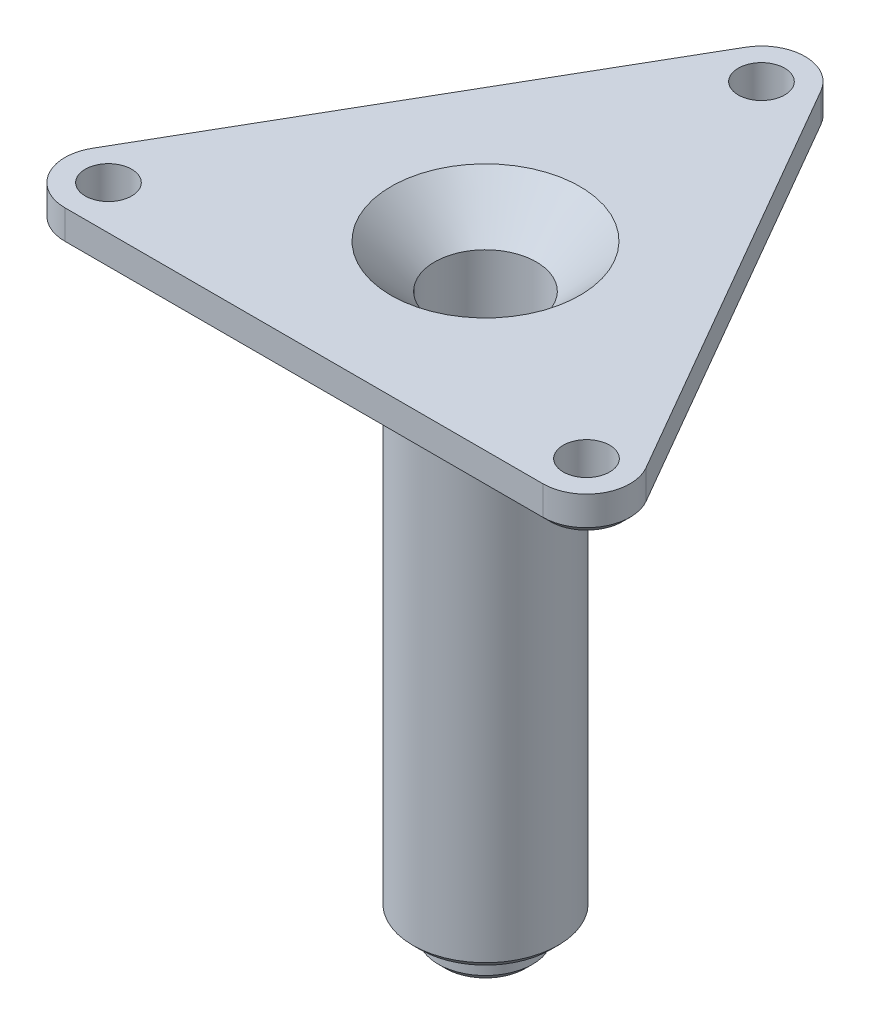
ISO-10303-21;
HEADER;
FILE_DESCRIPTION(('STEP AP214'),'2;1');
FILE_NAME('part.step','',(''),(''),'','','');
FILE_SCHEMA(('AUTOMOTIVE_DESIGN { 1 0 10303 214 1 1 1 1 }'));
ENDSEC;
DATA;
#1=APPLICATION_CONTEXT('core data for automotive mechanical design processes');
#2=APPLICATION_PROTOCOL_DEFINITION('international standard','automotive_design',2000,#1);
#3=PRODUCT_CONTEXT('',#1,'mechanical');
#4=PRODUCT('Part','Part','',(#3));
#5=PRODUCT_RELATED_PRODUCT_CATEGORY('part','',(#4));
#6=PRODUCT_DEFINITION_FORMATION('','',#4);
#7=PRODUCT_DEFINITION_CONTEXT('part definition',#1,'design');
#8=PRODUCT_DEFINITION('design','',#6,#7);
#9=PRODUCT_DEFINITION_SHAPE('','',#8);
#10=(LENGTH_UNIT() NAMED_UNIT(*) SI_UNIT(.MILLI.,.METRE.));
#11=(NAMED_UNIT(*) PLANE_ANGLE_UNIT() SI_UNIT($,.RADIAN.));
#12=(NAMED_UNIT(*) SI_UNIT($,.STERADIAN.) SOLID_ANGLE_UNIT());
#13=UNCERTAINTY_MEASURE_WITH_UNIT(LENGTH_MEASURE(1.E-05),#10,'distance_accuracy_value','');
#14=(GEOMETRIC_REPRESENTATION_CONTEXT(3) GLOBAL_UNCERTAINTY_ASSIGNED_CONTEXT((#13)) GLOBAL_UNIT_ASSIGNED_CONTEXT((#10,
#11,#12)) REPRESENTATION_CONTEXT('',''));
#15=CARTESIAN_POINT('',(0.,0.,0.));
#16=DIRECTION('',(0.,0.,1.));
#17=DIRECTION('',(1.,0.,0.));
#18=AXIS2_PLACEMENT_3D('',#15,#16,#17);
#19=CARTESIAN_POINT('',(3.04843682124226,-2.,-1.12673552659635));
#20=DIRECTION('',(-0.499999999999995,0.,0.866025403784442));
#21=DIRECTION('',(0.866025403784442,0.,0.499999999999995));
#22=AXIS2_PLACEMENT_3D('',#19,#20,#21);
#23=PLANE('',#22);
#24=DIRECTION('',(0.866025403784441,0.,0.499999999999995));
#25=VECTOR('',#24,1.);
#26=CARTESIAN_POINT('',(-0.548436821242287,-1.5,-3.20339149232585));
#27=LINE('',#26,#25);
#28=CARTESIAN_POINT('',(-0.548436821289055,-1.50000000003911,-3.2033914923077));
#29=VERTEX_POINT('',#28);
#30=CARTESIAN_POINT('',(3.04843682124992,-1.50000000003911,-1.12673552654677));
#31=VERTEX_POINT('',#30);
#32=EDGE_CURVE('E306',#29,#31,#27,.T.);
#33=ORIENTED_EDGE('',*,*,#32,.F.);
#34=DIRECTION('',(0.,1.,0.));
#35=VECTOR('',#34,1.);
#36=CARTESIAN_POINT('',(-0.548436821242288,-2.,-3.20339149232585));
#37=LINE('',#36,#35);
#38=CARTESIAN_POINT('',(-0.548436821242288,0.,-3.20339149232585));
#39=VERTEX_POINT('',#38);
#40=EDGE_CURVE('E478',#39,#29,#37,.F.);
#41=ORIENTED_EDGE('',*,*,#40,.F.);
#42=DIRECTION('',(0.866025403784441,0.,0.499999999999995));
#43=VECTOR('',#42,1.);
#44=CARTESIAN_POINT('',(-0.548436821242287,0.,-3.20339149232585));
#45=LINE('',#44,#43);
#46=CARTESIAN_POINT('',(3.04843682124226,0.,-1.12673552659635));
#47=VERTEX_POINT('',#46);
#48=EDGE_CURVE('E296',#39,#47,#45,.T.);
#49=ORIENTED_EDGE('',*,*,#48,.T.);
#50=DIRECTION('',(0.,1.,0.));
#51=VECTOR('',#50,1.);
#52=CARTESIAN_POINT('',(3.04843682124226,-2.,-1.12673552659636));
#53=LINE('',#52,#51);
#54=EDGE_CURVE('E475',#31,#47,#53,.T.);
#55=ORIENTED_EDGE('',*,*,#54,.F.);
#56=EDGE_LOOP('',(#33,#41,#49,#55));
#57=FACE_BOUND('',#56,.T.);
#58=ADVANCED_FACE('F17',(#57),#23,.F.);
#59=CARTESIAN_POINT('',(0.,-2.,0.));
#60=DIRECTION('',(0.,1.,0.));
#61=DIRECTION('',(0.,0.,1.));
#62=AXIS2_PLACEMENT_3D('',#59,#60,#61);
#63=CYLINDRICAL_SURFACE('',#62,3.25);
#64=ORIENTED_EDGE('',*,*,#54,.T.);
#65=CARTESIAN_POINT('',(0.,0.,0.));
#66=DIRECTION('',(0.,1.,0.));
#67=DIRECTION('',(0.,0.,1.));
#68=AXIS2_PLACEMENT_3D('',#65,#66,#67);
#69=CIRCLE('',#68,3.25);
#70=EDGE_CURVE('E299',#47,#39,#69,.F.);
#71=ORIENTED_EDGE('',*,*,#70,.T.);
#72=ORIENTED_EDGE('',*,*,#40,.T.);
#73=CARTESIAN_POINT('',(0.,-1.50000000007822,0.));
#74=DIRECTION('',(0.,1.,0.));
#75=DIRECTION('',(0.,0.,1.));
#76=AXIS2_PLACEMENT_3D('',#73,#74,#75);
#77=CIRCLE('',#76,3.24999999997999);
#78=EDGE_CURVE('E307',#31,#29,#77,.F.);
#79=ORIENTED_EDGE('',*,*,#78,.F.);
#80=EDGE_LOOP('',(#64,#71,#72,#79));
#81=FACE_BOUND('',#80,.T.);
#82=ADVANCED_FACE('F326',(#81),#63,.T.);
#83=CARTESIAN_POINT('',(0.,-1.50000000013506,0.));
#84=DIRECTION('',(0.,1.,0.));
#85=DIRECTION('',(0.,0.,1.));
#86=AXIS2_PLACEMENT_3D('',#83,#84,#85);
#87=CONICAL_SURFACE('',#86,3.2499999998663,0.785398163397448);
#88=ORIENTED_EDGE('',*,*,#78,.T.);
#89=CARTESIAN_POINT('',(-0.634587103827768,-2.,-2.67578011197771));
#90=CARTESIAN_POINT('',(-0.597477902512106,-1.76193187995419,-2.92925249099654));
#91=CARTESIAN_POINT('',(-0.548436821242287,-1.5,-3.20339149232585));
#92=B_SPLINE_CURVE_WITH_KNOTS('',2,(#89,#90,#91),.UNSPECIFIED.,.F.,.F.,(3,3),(0.,1.),.UNSPECIFIED.);
#93=CARTESIAN_POINT('',(-0.634587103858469,-1.99999999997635,-2.67578011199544));
#94=VERTEX_POINT('',#93);
#95=EDGE_CURVE('E301',#94,#29,#92,.T.);
#96=ORIENTED_EDGE('',*,*,#95,.F.);
#97=CARTESIAN_POINT('',(0.,-1.99999999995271,0.));
#98=DIRECTION('',(0.,1.,0.));
#99=DIRECTION('',(0.,0.,1.));
#100=AXIS2_PLACEMENT_3D('',#97,#98,#99);
#101=CIRCLE('',#100,2.75000000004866);
#102=CARTESIAN_POINT('',(2.63458710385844,-1.99999999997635,-0.788321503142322));
#103=VERTEX_POINT('',#102);
#104=EDGE_CURVE('E91',#103,#94,#101,.F.);
#105=ORIENTED_EDGE('',*,*,#104,.F.);
#106=CARTESIAN_POINT('',(3.04843682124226,-1.5,-1.12673552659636));
#107=CARTESIAN_POINT('',(2.83554602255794,-1.76193187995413,-0.947195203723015));
#108=CARTESIAN_POINT('',(2.63458710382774,-2.,-0.788321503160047));
#109=B_SPLINE_CURVE_WITH_KNOTS('',2,(#106,#107,#108),.UNSPECIFIED.,.F.,.F.,(3,3),(0.,1.),.UNSPECIFIED.);
#110=EDGE_CURVE('E300',#31,#103,#109,.T.);
#111=ORIENTED_EDGE('',*,*,#110,.F.);
#112=EDGE_LOOP('',(#88,#96,#105,#111));
#113=FACE_BOUND('',#112,.T.);
#114=ADVANCED_FACE('F321',(#113),#87,.T.);
#115=CARTESIAN_POINT('',(0.999999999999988,-2.,-1.73205080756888));
#116=DIRECTION('',(0.353553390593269,-0.707106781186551,-0.612372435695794));
#117=DIRECTION('',(0.,0.654653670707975,-0.755928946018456));
#118=AXIS2_PLACEMENT_3D('',#115,#116,#117);
#119=PLANE('',#118);
#120=ORIENTED_EDGE('',*,*,#110,.T.);
#121=DIRECTION('',(0.866025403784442,0.,0.499999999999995));
#122=VECTOR('',#121,1.);
#123=CARTESIAN_POINT('',(-0.634587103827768,-2.,-2.67578011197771));
#124=LINE('',#123,#122);
#125=EDGE_CURVE('E293',#94,#103,#124,.T.);
#126=ORIENTED_EDGE('',*,*,#125,.F.);
#127=ORIENTED_EDGE('',*,*,#95,.T.);
#128=ORIENTED_EDGE('',*,*,#32,.T.);
#129=EDGE_LOOP('',(#120,#126,#127,#128));
#130=FACE_BOUND('',#129,.T.);
#131=ADVANCED_FACE('F310',(#130),#119,.T.);
#132=CARTESIAN_POINT('',(0.,0.,0.));
#133=DIRECTION('',(0.,1.,0.));
#134=DIRECTION('',(0.,0.,1.));
#135=AXIS2_PLACEMENT_3D('',#132,#133,#134);
#136=PLANE('',#135);
#137=ORIENTED_EDGE('',*,*,#48,.F.);
#138=ORIENTED_EDGE('',*,*,#70,.F.);
#139=EDGE_LOOP('',(#137,#138));
#140=FACE_BOUND('',#139,.T.);
#141=CARTESIAN_POINT('',(0.,-5.6843418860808E-11,0.));
#142=DIRECTION('',(0.,1.,0.));
#143=DIRECTION('',(0.,0.,1.));
#144=AXIS2_PLACEMENT_3D('',#141,#142,#143);
#145=CIRCLE('',#144,4.50000000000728);
#146=CARTESIAN_POINT('',(0.,-5.6843418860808E-11,4.50000000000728));
#147=VERTEX_POINT('',#146);
#148=EDGE_CURVE('E295',#147,#147,#145,.T.);
#149=ORIENTED_EDGE('',*,*,#148,.F.);
#150=EDGE_LOOP('',(#149));
#151=FACE_BOUND('',#150,.T.);
#152=ADVANCED_FACE('F320',(#140,#151),#136,.F.);
#153=CARTESIAN_POINT('',(0.,-2.,0.));
#154=DIRECTION('',(0.,-1.,0.));
#155=DIRECTION('',(0.,0.,-1.));
#156=AXIS2_PLACEMENT_3D('',#153,#154,#155);
#157=PLANE('',#156);
#158=ORIENTED_EDGE('',*,*,#104,.T.);
#159=ORIENTED_EDGE('',*,*,#125,.T.);
#160=EDGE_LOOP('',(#158,#159));
#161=FACE_BOUND('',#160,.T.);
#162=CARTESIAN_POINT('',(0.,-2.,0.));
#163=DIRECTION('',(0.,-1.,0.));
#164=DIRECTION('',(0.,0.,-1.));
#165=AXIS2_PLACEMENT_3D('',#162,#163,#164);
#166=CIRCLE('',#165,1.24999999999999);
#167=CARTESIAN_POINT('',(0.,-2.,-1.24999999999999));
#168=VERTEX_POINT('',#167);
#169=EDGE_CURVE('E292',#168,#168,#166,.F.);
#170=ORIENTED_EDGE('',*,*,#169,.T.);
#171=EDGE_LOOP('',(#170));
#172=FACE_BOUND('',#171,.T.);
#173=ADVANCED_FACE('F461',(#161,#172),#157,.T.);
#174=CARTESIAN_POINT('',(0.,0.499999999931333,0.));
#175=DIRECTION('',(0.,1.,0.));
#176=DIRECTION('',(0.,0.,1.));
#177=AXIS2_PLACEMENT_3D('',#174,#175,#176);
#178=CONICAL_SURFACE('',#177,5.0000000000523,0.785398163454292);
#179=CARTESIAN_POINT('',(0.,0.500000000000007,0.));
#180=DIRECTION('',(0.,1.,0.));
#181=DIRECTION('',(0.,0.,1.));
#182=AXIS2_PLACEMENT_3D('',#179,#180,#181);
#183=CIRCLE('',#182,5.00000000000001);
#184=CARTESIAN_POINT('',(0.,0.500000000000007,5.00000000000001));
#185=VERTEX_POINT('',#184);
#186=EDGE_CURVE('E289',#185,#185,#183,.T.);
#187=ORIENTED_EDGE('',*,*,#186,.F.);
#188=EDGE_LOOP('',(#187));
#189=FACE_BOUND('',#188,.T.);
#190=ORIENTED_EDGE('',*,*,#148,.T.);
#191=EDGE_LOOP('',(#190));
#192=FACE_BOUND('',#191,.T.);
#193=ADVANCED_FACE('F458',(#189,#192),#178,.T.);
#194=CARTESIAN_POINT('',(0.,-2.,0.));
#195=DIRECTION('',(0.,-1.,0.));
#196=DIRECTION('',(0.,0.,-1.));
#197=AXIS2_PLACEMENT_3D('',#194,#195,#196);
#198=CYLINDRICAL_SURFACE('',#197,1.24999999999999);
#199=ORIENTED_EDGE('',*,*,#169,.F.);
#200=EDGE_LOOP('',(#199));
#201=FACE_BOUND('',#200,.T.);
#202=CARTESIAN_POINT('',(0.,5.,0.));
#203=DIRECTION('',(0.,-1.,0.));
#204=DIRECTION('',(0.,0.,-1.));
#205=AXIS2_PLACEMENT_3D('',#202,#203,#204);
#206=CIRCLE('',#205,1.24999999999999);
#207=CARTESIAN_POINT('',(0.,5.,-1.24999999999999));
#208=VERTEX_POINT('',#207);
#209=EDGE_CURVE('E288',#208,#208,#206,.T.);
#210=ORIENTED_EDGE('',*,*,#209,.F.);
#211=EDGE_LOOP('',(#210));
#212=FACE_BOUND('',#211,.T.);
#213=ADVANCED_FACE('F455',(#201,#212),#198,.F.);
#214=CARTESIAN_POINT('',(0.,61.2763291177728,0.));
#215=DIRECTION('',(0.,1.,0.));
#216=DIRECTION('',(0.,0.,1.));
#217=AXIS2_PLACEMENT_3D('',#214,#215,#216);
#218=CYLINDRICAL_SURFACE('',#217,5.00000000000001);
#219=CARTESIAN_POINT('',(0.,32.5,0.));
#220=DIRECTION('',(0.,1.,0.));
#221=DIRECTION('',(0.,0.,1.));
#222=AXIS2_PLACEMENT_3D('',#219,#220,#221);
#223=CIRCLE('',#222,5.00000000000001);
#224=CARTESIAN_POINT('',(0.,32.5,5.00000000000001));
#225=VERTEX_POINT('',#224);
#226=EDGE_CURVE('E279',#225,#225,#223,.F.);
#227=ORIENTED_EDGE('',*,*,#226,.T.);
#228=EDGE_LOOP('',(#227));
#229=FACE_BOUND('',#228,.T.);
#230=ORIENTED_EDGE('',*,*,#186,.T.);
#231=EDGE_LOOP('',(#230));
#232=FACE_BOUND('',#231,.T.);
#233=ADVANCED_FACE('F452',(#229,#232),#218,.T.);
#234=CARTESIAN_POINT('',(0.,5.,0.));
#235=DIRECTION('',(0.,1.,0.));
#236=DIRECTION('',(0.,0.,1.));
#237=AXIS2_PLACEMENT_3D('',#234,#235,#236);
#238=PLANE('',#237);
#239=ORIENTED_EDGE('',*,*,#209,.T.);
#240=EDGE_LOOP('',(#239));
#241=FACE_BOUND('',#240,.T.);
#242=CARTESIAN_POINT('',(0.,5.,0.));
#243=DIRECTION('',(0.,1.,0.));
#244=DIRECTION('',(0.,0.,1.));
#245=AXIS2_PLACEMENT_3D('',#242,#243,#244);
#246=CIRCLE('',#245,3.5);
#247=CARTESIAN_POINT('',(0.,5.,3.5));
#248=VERTEX_POINT('',#247);
#249=EDGE_CURVE('E287',#248,#248,#246,.T.);
#250=ORIENTED_EDGE('',*,*,#249,.T.);
#251=EDGE_LOOP('',(#250));
#252=FACE_BOUND('',#251,.T.);
#253=ADVANCED_FACE('F272',(#241,#252),#238,.T.);
#254=CARTESIAN_POINT('',(0.,32.5,0.));
#255=DIRECTION('',(0.,1.,0.));
#256=DIRECTION('',(0.,0.,1.));
#257=AXIS2_PLACEMENT_3D('',#254,#255,#256);
#258=TOROIDAL_SURFACE('',#257,10.,5.);
#259=CARTESIAN_POINT('',(0.,37.5,0.));
#260=DIRECTION('',(0.,-1.,0.));
#261=DIRECTION('',(0.,0.,-1.));
#262=AXIS2_PLACEMENT_3D('',#259,#260,#261);
#263=CIRCLE('',#262,10.);
#264=CARTESIAN_POINT('',(0.,37.5,-10.));
#265=VERTEX_POINT('',#264);
#266=CARTESIAN_POINT('',(0.,37.5,10.));
#267=VERTEX_POINT('',#266);
#268=EDGE_CURVE('E439',#265,#267,#263,.T.);
#269=ORIENTED_EDGE('',*,*,#268,.T.);
#270=CARTESIAN_POINT('',(0.,37.5,0.));
#271=DIRECTION('',(0.,-1.,0.));
#272=DIRECTION('',(0.,0.,1.));
#273=AXIS2_PLACEMENT_3D('',#270,#271,#272);
#274=CIRCLE('',#273,10.);
#275=EDGE_CURVE('E97',#267,#265,#274,.T.);
#276=ORIENTED_EDGE('',*,*,#275,.T.);
#277=EDGE_LOOP('',(#269,#276));
#278=FACE_BOUND('',#277,.T.);
#279=ORIENTED_EDGE('',*,*,#226,.F.);
#280=EDGE_LOOP('',(#279));
#281=FACE_BOUND('',#280,.T.);
#282=ADVANCED_FACE('F268',(#278,#281),#258,.F.);
#283=CARTESIAN_POINT('',(0.,5.,0.));
#284=DIRECTION('',(0.,1.,0.));
#285=DIRECTION('',(0.,0.,1.));
#286=AXIS2_PLACEMENT_3D('',#283,#284,#285);
#287=CYLINDRICAL_SURFACE('',#286,3.5);
#288=CARTESIAN_POINT('',(0.,36.9999999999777,0.));
#289=DIRECTION('',(0.,1.,0.));
#290=DIRECTION('',(0.,0.,1.));
#291=AXIS2_PLACEMENT_3D('',#288,#289,#290);
#292=CIRCLE('',#291,3.49999999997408);
#293=CARTESIAN_POINT('',(0.,36.9999999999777,3.49999999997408));
#294=VERTEX_POINT('',#293);
#295=EDGE_CURVE('E130',#294,#294,#292,.T.);
#296=ORIENTED_EDGE('',*,*,#295,.T.);
#297=EDGE_LOOP('',(#296));
#298=FACE_BOUND('',#297,.T.);
#299=ORIENTED_EDGE('',*,*,#249,.F.);
#300=EDGE_LOOP('',(#299));
#301=FACE_BOUND('',#300,.T.);
#302=ADVANCED_FACE('F245',(#298,#301),#287,.F.);
#303=CARTESIAN_POINT('',(5.00000000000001,37.5,0.));
#304=DIRECTION('',(0.,1.,0.));
#305=DIRECTION('',(0.,0.,1.));
#306=AXIS2_PLACEMENT_3D('',#303,#304,#305);
#307=PLANE('',#306);
#308=CARTESIAN_POINT('',(0.,37.5,-19.));
#309=DIRECTION('',(0.,1.,0.));
#310=DIRECTION('',(0.,0.,1.));
#311=AXIS2_PLACEMENT_3D('',#308,#309,#310);
#312=CIRCLE('',#311,1.6);
#313=CARTESIAN_POINT('',(0.,37.5,-17.4));
#314=VERTEX_POINT('',#313);
#315=EDGE_CURVE('E195',#314,#314,#312,.T.);
#316=ORIENTED_EDGE('',*,*,#315,.T.);
#317=EDGE_LOOP('',(#316));
#318=FACE_BOUND('',#317,.T.);
#319=CARTESIAN_POINT('',(16.4544826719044,37.5,9.49999999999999));
#320=DIRECTION('',(0.,1.,0.));
#321=DIRECTION('',(0.,0.,1.));
#322=AXIS2_PLACEMENT_3D('',#319,#320,#321);
#323=CIRCLE('',#322,1.6);
#324=CARTESIAN_POINT('',(16.4544826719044,37.5,11.1));
#325=VERTEX_POINT('',#324);
#326=EDGE_CURVE('E431',#325,#325,#323,.T.);
#327=ORIENTED_EDGE('',*,*,#326,.T.);
#328=EDGE_LOOP('',(#327));
#329=FACE_BOUND('',#328,.T.);
#330=CARTESIAN_POINT('',(-16.4544826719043,37.5,9.50000000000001));
#331=DIRECTION('',(0.,1.,0.));
#332=DIRECTION('',(0.,0.,1.));
#333=AXIS2_PLACEMENT_3D('',#330,#331,#332);
#334=CIRCLE('',#333,1.6);
#335=CARTESIAN_POINT('',(-16.4544826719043,37.5,11.1));
#336=VERTEX_POINT('',#335);
#337=EDGE_CURVE('E259',#336,#336,#334,.T.);
#338=ORIENTED_EDGE('',*,*,#337,.T.);
#339=EDGE_LOOP('',(#338));
#340=FACE_BOUND('',#339,.T.);
#341=CARTESIAN_POINT('',(0.,37.5000000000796,-19.));
#342=DIRECTION('',(0.,1.,0.));
#343=DIRECTION('',(0.,0.,1.));
#344=AXIS2_PLACEMENT_3D('',#341,#342,#343);
#345=CIRCLE('',#344,2.49999999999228);
#346=CARTESIAN_POINT('',(2.16506350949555,37.5000000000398,-20.2500000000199));
#347=VERTEX_POINT('',#346);
#348=CARTESIAN_POINT('',(-2.16506350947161,37.5000000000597,-20.2499999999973));
#349=VERTEX_POINT('',#348);
#350=EDGE_CURVE('E190',#347,#349,#345,.T.);
#351=ORIENTED_EDGE('',*,*,#350,.F.);
#352=DIRECTION('',(-0.5,0.,-0.866025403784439));
#353=VECTOR('',#352,1.);
#354=CARTESIAN_POINT('',(18.6195461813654,37.5,8.25));
#355=LINE('',#354,#353);
#356=CARTESIAN_POINT('',(18.6195461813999,37.5000000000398,8.2499999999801));
#357=VERTEX_POINT('',#356);
#358=EDGE_CURVE('E125',#357,#347,#355,.T.);
#359=ORIENTED_EDGE('',*,*,#358,.F.);
#360=CARTESIAN_POINT('',(16.4544826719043,37.5000000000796,9.5));
#361=DIRECTION('',(0.,1.,0.));
#362=DIRECTION('',(0.,0.,1.));
#363=AXIS2_PLACEMENT_3D('',#360,#361,#362);
#364=CIRCLE('',#363,2.50000000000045);
#365=CARTESIAN_POINT('',(16.4544826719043,37.5000000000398,12.0000000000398));
#366=VERTEX_POINT('',#365);
#367=EDGE_CURVE('E226',#366,#357,#364,.T.);
#368=ORIENTED_EDGE('',*,*,#367,.F.);
#369=DIRECTION('',(1.,0.,0.));
#370=VECTOR('',#369,1.);
#371=CARTESIAN_POINT('',(-21.650635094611,37.5,12.));
#372=LINE('',#371,#370);
#373=CARTESIAN_POINT('',(-16.4544826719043,37.4999999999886,11.9999999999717));
#374=VERTEX_POINT('',#373);
#375=EDGE_CURVE('E221',#374,#366,#372,.T.);
#376=ORIENTED_EDGE('',*,*,#375,.F.);
#377=CARTESIAN_POINT('',(-16.4544826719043,37.5000000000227,9.5));
#378=DIRECTION('',(0.,1.,0.));
#379=DIRECTION('',(0.,0.,1.));
#380=AXIS2_PLACEMENT_3D('',#377,#378,#379);
#381=CIRCLE('',#380,2.50000000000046);
#382=CARTESIAN_POINT('',(-18.6195461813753,37.5000000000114,8.24999999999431));
#383=VERTEX_POINT('',#382);
#384=EDGE_CURVE('E212',#383,#374,#381,.T.);
#385=ORIENTED_EDGE('',*,*,#384,.F.);
#386=DIRECTION('',(-0.5,0.,0.866025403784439));
#387=VECTOR('',#386,1.);
#388=CARTESIAN_POINT('',(-2.1650635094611,37.5,-20.25));
#389=LINE('',#388,#387);
#390=EDGE_CURVE('E203',#349,#383,#389,.T.);
#391=ORIENTED_EDGE('',*,*,#390,.F.);
#392=EDGE_LOOP('',(#351,#359,#368,#376,#385,#391));
#393=FACE_BOUND('',#392,.T.);
#394=ORIENTED_EDGE('',*,*,#275,.F.);
#395=ORIENTED_EDGE('',*,*,#268,.F.);
#396=EDGE_LOOP('',(#394,#395));
#397=FACE_BOUND('',#396,.T.);
#398=ADVANCED_FACE('F234',(#318,#329,#340,#393,#397),#307,.F.);
#399=CARTESIAN_POINT('',(16.4544826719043,38.0000000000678,9.5));
#400=DIRECTION('',(0.,1.,0.));
#401=DIRECTION('',(0.,0.,1.));
#402=AXIS2_PLACEMENT_3D('',#399,#400,#401);
#403=CONICAL_SURFACE('',#402,2.99999999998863,0.785398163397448);
#404=DIRECTION('',(-0.612372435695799,-0.707106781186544,0.353553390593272));
#405=VECTOR('',#404,1.);
#406=CARTESIAN_POINT('',(19.0525588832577,38.,8.));
#407=LINE('',#406,#405);
#408=CARTESIAN_POINT('',(19.0525588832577,38.,8.));
#409=VERTEX_POINT('',#408);
#410=EDGE_CURVE('E188',#409,#357,#407,.T.);
#411=ORIENTED_EDGE('',*,*,#410,.F.);
#412=CARTESIAN_POINT('',(16.4544826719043,38.,9.5));
#413=DIRECTION('',(0.,1.,0.));
#414=DIRECTION('',(0.,0.,1.));
#415=AXIS2_PLACEMENT_3D('',#412,#413,#414);
#416=CIRCLE('',#415,3.);
#417=CARTESIAN_POINT('',(16.4544826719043,38.,12.5));
#418=VERTEX_POINT('',#417);
#419=EDGE_CURVE('E193',#418,#409,#416,.T.);
#420=ORIENTED_EDGE('',*,*,#419,.F.);
#421=DIRECTION('',(0.,-0.707106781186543,-0.707106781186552));
#422=VECTOR('',#421,1.);
#423=CARTESIAN_POINT('',(16.4544826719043,38.,12.5));
#424=LINE('',#423,#422);
#425=EDGE_CURVE('E224',#366,#418,#424,.F.);
#426=ORIENTED_EDGE('',*,*,#425,.F.);
#427=ORIENTED_EDGE('',*,*,#367,.T.);
#428=EDGE_LOOP('',(#411,#420,#426,#427));
#429=FACE_BOUND('',#428,.T.);
#430=ADVANCED_FACE('F244',(#429),#403,.T.);
#431=CARTESIAN_POINT('',(-21.650635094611,38.,12.5));
#432=DIRECTION('',(0.,-0.707106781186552,0.707106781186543));
#433=DIRECTION('',(0.,-0.707106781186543,-0.707106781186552));
#434=AXIS2_PLACEMENT_3D('',#431,#432,#433);
#435=PLANE('',#434);
#436=DIRECTION('',(0.,-0.707106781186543,-0.707106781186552));
#437=VECTOR('',#436,1.);
#438=CARTESIAN_POINT('',(-16.4544826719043,499000.,498974.500000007));
#439=LINE('',#438,#437);
#440=CARTESIAN_POINT('',(-16.4544826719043,37.9999999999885,12.4999999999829));
#441=VERTEX_POINT('',#440);
#442=EDGE_CURVE('E219',#374,#441,#439,.F.);
#443=ORIENTED_EDGE('',*,*,#442,.F.);
#444=ORIENTED_EDGE('',*,*,#375,.T.);
#445=ORIENTED_EDGE('',*,*,#425,.T.);
#446=DIRECTION('',(1.,0.,0.));
#447=VECTOR('',#446,1.);
#448=CARTESIAN_POINT('',(-21.650635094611,38.,12.5));
#449=LINE('',#448,#447);
#450=EDGE_CURVE('E179',#441,#418,#449,.T.);
#451=ORIENTED_EDGE('',*,*,#450,.F.);
#452=EDGE_LOOP('',(#443,#444,#445,#451));
#453=FACE_BOUND('',#452,.T.);
#454=ADVANCED_FACE('F389',(#453),#435,.T.);
#455=CARTESIAN_POINT('',(-16.4544826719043,37.9999999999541,9.5));
#456=DIRECTION('',(0.,1.,0.));
#457=DIRECTION('',(0.,0.,1.));
#458=AXIS2_PLACEMENT_3D('',#455,#456,#457);
#459=CONICAL_SURFACE('',#458,2.99999999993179,0.785398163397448);
#460=DIRECTION('',(-0.612372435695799,0.707106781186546,-0.353553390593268));
#461=VECTOR('',#460,1.);
#462=CARTESIAN_POINT('',(-18.6195461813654,37.5,8.25));
#463=LINE('',#462,#461);
#464=CARTESIAN_POINT('',(-19.0525588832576,38.,8.));
#465=VERTEX_POINT('',#464);
#466=EDGE_CURVE('E210',#383,#465,#463,.T.);
#467=ORIENTED_EDGE('',*,*,#466,.F.);
#468=ORIENTED_EDGE('',*,*,#384,.T.);
#469=ORIENTED_EDGE('',*,*,#442,.T.);
#470=CARTESIAN_POINT('',(-16.4544826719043,38.,9.5));
#471=DIRECTION('',(0.,1.,0.));
#472=DIRECTION('',(0.,0.,1.));
#473=AXIS2_PLACEMENT_3D('',#470,#471,#472);
#474=CIRCLE('',#473,3.);
#475=EDGE_CURVE('E174',#465,#441,#474,.T.);
#476=ORIENTED_EDGE('',*,*,#475,.F.);
#477=EDGE_LOOP('',(#467,#468,#469,#476));
#478=FACE_BOUND('',#477,.T.);
#479=ADVANCED_FACE('F386',(#478),#459,.T.);
#480=CARTESIAN_POINT('',(0.,38.,-25.));
#481=DIRECTION('',(-0.612372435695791,-0.707106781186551,-0.353553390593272));
#482=DIRECTION('',(0.755928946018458,-0.654653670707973,0.));
#483=AXIS2_PLACEMENT_3D('',#480,#481,#482);
#484=PLANE('',#483);
#485=DIRECTION('',(0.612372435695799,-0.707106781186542,0.353553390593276));
#486=VECTOR('',#485,1.);
#487=CARTESIAN_POINT('',(-432116.365599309,499000.,-249501.500000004));
#488=LINE('',#487,#486);
#489=CARTESIAN_POINT('',(-2.5980762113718,38.0000000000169,-20.4999999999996));
#490=VERTEX_POINT('',#489);
#491=EDGE_CURVE('E142',#349,#490,#488,.F.);
#492=ORIENTED_EDGE('',*,*,#491,.F.);
#493=ORIENTED_EDGE('',*,*,#390,.T.);
#494=ORIENTED_EDGE('',*,*,#466,.T.);
#495=DIRECTION('',(-0.5,0.,0.866025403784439));
#496=VECTOR('',#495,1.);
#497=CARTESIAN_POINT('',(0.,38.,-25.));
#498=LINE('',#497,#496);
#499=EDGE_CURVE('E169',#490,#465,#498,.T.);
#500=ORIENTED_EDGE('',*,*,#499,.F.);
#501=EDGE_LOOP('',(#492,#493,#494,#500));
#502=FACE_BOUND('',#501,.T.);
#503=ADVANCED_FACE('F383',(#502),#484,.T.);
#504=CARTESIAN_POINT('',(0.,38.0000000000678,-19.));
#505=DIRECTION('',(0.,1.,0.));
#506=DIRECTION('',(0.,0.,1.));
#507=AXIS2_PLACEMENT_3D('',#504,#505,#506);
#508=CONICAL_SURFACE('',#507,2.99999999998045,0.785398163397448);
#509=DIRECTION('',(0.612372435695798,0.707106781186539,-0.353553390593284));
#510=VECTOR('',#509,1.);
#511=CARTESIAN_POINT('',(2.16506350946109,37.5,-20.25));
#512=LINE('',#511,#510);
#513=CARTESIAN_POINT('',(2.59807621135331,38.,-20.5));
#514=VERTEX_POINT('',#513);
#515=EDGE_CURVE('E120',#347,#514,#512,.T.);
#516=ORIENTED_EDGE('',*,*,#515,.F.);
#517=ORIENTED_EDGE('',*,*,#350,.T.);
#518=ORIENTED_EDGE('',*,*,#491,.T.);
#519=CARTESIAN_POINT('',(0.,38.,-19.));
#520=DIRECTION('',(0.,1.,0.));
#521=DIRECTION('',(0.,0.,1.));
#522=AXIS2_PLACEMENT_3D('',#519,#520,#521);
#523=CIRCLE('',#522,3.);
#524=EDGE_CURVE('E139',#514,#490,#523,.T.);
#525=ORIENTED_EDGE('',*,*,#524,.F.);
#526=EDGE_LOOP('',(#516,#517,#518,#525));
#527=FACE_BOUND('',#526,.T.);
#528=ADVANCED_FACE('F140',(#527),#508,.T.);
#529=CARTESIAN_POINT('',(21.650635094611,38.,12.5));
#530=DIRECTION('',(0.612372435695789,-0.707106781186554,-0.353553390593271));
#531=DIRECTION('',(0.75592894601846,0.654653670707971,0.));
#532=AXIS2_PLACEMENT_3D('',#529,#530,#531);
#533=PLANE('',#532);
#534=ORIENTED_EDGE('',*,*,#515,.T.);
#535=DIRECTION('',(-0.5,0.,-0.866025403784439));
#536=VECTOR('',#535,1.);
#537=CARTESIAN_POINT('',(21.650635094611,38.,12.5));
#538=LINE('',#537,#536);
#539=EDGE_CURVE('E123',#409,#514,#538,.T.);
#540=ORIENTED_EDGE('',*,*,#539,.F.);
#541=ORIENTED_EDGE('',*,*,#410,.T.);
#542=ORIENTED_EDGE('',*,*,#358,.T.);
#543=EDGE_LOOP('',(#534,#540,#541,#542));
#544=FACE_BOUND('',#543,.T.);
#545=ADVANCED_FACE('F121',(#544),#533,.T.);
#546=CARTESIAN_POINT('',(0.,40.0000000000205,0.));
#547=DIRECTION('',(0.,1.,0.));
#548=DIRECTION('',(0.,0.,1.));
#549=AXIS2_PLACEMENT_3D('',#546,#547,#548);
#550=CONICAL_SURFACE('',#549,6.49999999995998,0.785398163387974);
#551=CARTESIAN_POINT('',(0.,40.0000000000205,0.));
#552=DIRECTION('',(0.,1.,0.));
#553=DIRECTION('',(0.,0.,1.));
#554=AXIS2_PLACEMENT_3D('',#551,#552,#553);
#555=CIRCLE('',#554,6.49999999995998);
#556=CARTESIAN_POINT('',(0.,40.0000000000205,6.49999999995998));
#557=VERTEX_POINT('',#556);
#558=EDGE_CURVE('E151',#557,#557,#555,.T.);
#559=ORIENTED_EDGE('',*,*,#558,.T.);
#560=EDGE_LOOP('',(#559));
#561=FACE_BOUND('',#560,.T.);
#562=ORIENTED_EDGE('',*,*,#295,.F.);
#563=EDGE_LOOP('',(#562));
#564=FACE_BOUND('',#563,.T.);
#565=ADVANCED_FACE('F374',(#561,#564),#550,.F.);
#566=CARTESIAN_POINT('',(-16.4544826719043,32.9745166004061,9.50000000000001));
#567=DIRECTION('',(0.,1.,0.));
#568=DIRECTION('',(0.,0.,1.));
#569=AXIS2_PLACEMENT_3D('',#566,#567,#568);
#570=CYLINDRICAL_SURFACE('',#569,1.6);
#571=ORIENTED_EDGE('',*,*,#337,.F.);
#572=EDGE_LOOP('',(#571));
#573=FACE_BOUND('',#572,.T.);
#574=CARTESIAN_POINT('',(-16.4544826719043,40.,9.50000000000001));
#575=DIRECTION('',(0.,1.,0.));
#576=DIRECTION('',(0.,0.,1.));
#577=AXIS2_PLACEMENT_3D('',#574,#575,#576);
#578=CIRCLE('',#577,1.6);
#579=CARTESIAN_POINT('',(-16.4544826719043,40.,11.1));
#580=VERTEX_POINT('',#579);
#581=EDGE_CURVE('E154',#580,#580,#578,.T.);
#582=ORIENTED_EDGE('',*,*,#581,.T.);
#583=EDGE_LOOP('',(#582));
#584=FACE_BOUND('',#583,.T.);
#585=ADVANCED_FACE('F370',(#573,#584),#570,.F.);
#586=CARTESIAN_POINT('',(16.4544826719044,32.9745166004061,9.49999999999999));
#587=DIRECTION('',(0.,1.,0.));
#588=DIRECTION('',(0.,0.,1.));
#589=AXIS2_PLACEMENT_3D('',#586,#587,#588);
#590=CYLINDRICAL_SURFACE('',#589,1.6);
#591=ORIENTED_EDGE('',*,*,#326,.F.);
#592=EDGE_LOOP('',(#591));
#593=FACE_BOUND('',#592,.T.);
#594=CARTESIAN_POINT('',(16.4544826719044,40.,9.49999999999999));
#595=DIRECTION('',(0.,1.,0.));
#596=DIRECTION('',(0.,0.,1.));
#597=AXIS2_PLACEMENT_3D('',#594,#595,#596);
#598=CIRCLE('',#597,1.6);
#599=CARTESIAN_POINT('',(16.4544826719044,40.,11.1));
#600=VERTEX_POINT('',#599);
#601=EDGE_CURVE('E424',#600,#600,#598,.T.);
#602=ORIENTED_EDGE('',*,*,#601,.T.);
#603=EDGE_LOOP('',(#602));
#604=FACE_BOUND('',#603,.T.);
#605=ADVANCED_FACE('F366',(#593,#604),#590,.F.);
#606=CARTESIAN_POINT('',(0.,32.9745166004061,-19.));
#607=DIRECTION('',(0.,1.,0.));
#608=DIRECTION('',(0.,0.,1.));
#609=AXIS2_PLACEMENT_3D('',#606,#607,#608);
#610=CYLINDRICAL_SURFACE('',#609,1.6);
#611=ORIENTED_EDGE('',*,*,#315,.F.);
#612=EDGE_LOOP('',(#611));
#613=FACE_BOUND('',#612,.T.);
#614=CARTESIAN_POINT('',(0.,40.,-19.));
#615=DIRECTION('',(0.,1.,0.));
#616=DIRECTION('',(0.,0.,1.));
#617=AXIS2_PLACEMENT_3D('',#614,#615,#616);
#618=CIRCLE('',#617,1.6);
#619=CARTESIAN_POINT('',(0.,40.,-17.4));
#620=VERTEX_POINT('',#619);
#621=EDGE_CURVE('E421',#620,#620,#618,.T.);
#622=ORIENTED_EDGE('',*,*,#621,.T.);
#623=EDGE_LOOP('',(#622));
#624=FACE_BOUND('',#623,.T.);
#625=ADVANCED_FACE('F362',(#613,#624),#610,.F.);
#626=CARTESIAN_POINT('',(16.4544826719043,30.,9.5));
#627=DIRECTION('',(0.,1.,0.));
#628=DIRECTION('',(0.,0.,1.));
#629=AXIS2_PLACEMENT_3D('',#626,#627,#628);
#630=CYLINDRICAL_SURFACE('',#629,3.);
#631=DIRECTION('',(0.,1.,0.));
#632=VECTOR('',#631,1.);
#633=CARTESIAN_POINT('',(19.0525588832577,30.,8.));
#634=LINE('',#633,#632);
#635=CARTESIAN_POINT('',(19.0525588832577,40.,8.));
#636=VERTEX_POINT('',#635);
#637=EDGE_CURVE('E135',#636,#409,#634,.F.);
#638=ORIENTED_EDGE('',*,*,#637,.F.);
#639=CARTESIAN_POINT('',(16.4544826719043,40.,9.5));
#640=DIRECTION('',(0.,1.,0.));
#641=DIRECTION('',(0.,0.,1.));
#642=AXIS2_PLACEMENT_3D('',#639,#640,#641);
#643=CIRCLE('',#642,3.);
#644=CARTESIAN_POINT('',(16.4544826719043,40.,12.5));
#645=VERTEX_POINT('',#644);
#646=EDGE_CURVE('E416',#636,#645,#643,.F.);
#647=ORIENTED_EDGE('',*,*,#646,.T.);
#648=DIRECTION('',(0.,1.,0.));
#649=VECTOR('',#648,1.);
#650=CARTESIAN_POINT('',(16.4544826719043,30.,12.5));
#651=LINE('',#650,#649);
#652=EDGE_CURVE('E177',#418,#645,#651,.T.);
#653=ORIENTED_EDGE('',*,*,#652,.F.);
#654=ORIENTED_EDGE('',*,*,#419,.T.);
#655=EDGE_LOOP('',(#638,#647,#653,#654));
#656=FACE_BOUND('',#655,.T.);
#657=ADVANCED_FACE('F358',(#656),#630,.T.);
#658=CARTESIAN_POINT('',(-21.650635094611,30.,12.5));
#659=DIRECTION('',(0.,0.,1.));
#660=DIRECTION('',(1.,0.,0.));
#661=AXIS2_PLACEMENT_3D('',#658,#659,#660);
#662=PLANE('',#661);
#663=ORIENTED_EDGE('',*,*,#652,.T.);
#664=DIRECTION('',(1.,0.,0.));
#665=VECTOR('',#664,1.);
#666=CARTESIAN_POINT('',(30.,40.,12.5));
#667=LINE('',#666,#665);
#668=CARTESIAN_POINT('',(-16.4544826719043,40.,12.5));
#669=VERTEX_POINT('',#668);
#670=EDGE_CURVE('E158',#645,#669,#667,.F.);
#671=ORIENTED_EDGE('',*,*,#670,.T.);
#672=DIRECTION('',(0.,1.,0.));
#673=VECTOR('',#672,1.);
#674=CARTESIAN_POINT('',(-16.4544826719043,30.,12.5));
#675=LINE('',#674,#673);
#676=EDGE_CURVE('E172',#441,#669,#675,.T.);
#677=ORIENTED_EDGE('',*,*,#676,.F.);
#678=ORIENTED_EDGE('',*,*,#450,.T.);
#679=EDGE_LOOP('',(#663,#671,#677,#678));
#680=FACE_BOUND('',#679,.T.);
#681=ADVANCED_FACE('F354',(#680),#662,.T.);
#682=CARTESIAN_POINT('',(-16.4544826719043,30.,9.5));
#683=DIRECTION('',(0.,1.,0.));
#684=DIRECTION('',(0.,0.,1.));
#685=AXIS2_PLACEMENT_3D('',#682,#683,#684);
#686=CYLINDRICAL_SURFACE('',#685,3.);
#687=ORIENTED_EDGE('',*,*,#676,.T.);
#688=CARTESIAN_POINT('',(-16.4544826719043,40.,9.5));
#689=DIRECTION('',(0.,1.,0.));
#690=DIRECTION('',(0.,0.,1.));
#691=AXIS2_PLACEMENT_3D('',#688,#689,#690);
#692=CIRCLE('',#691,3.);
#693=CARTESIAN_POINT('',(-19.0525588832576,40.,8.));
#694=VERTEX_POINT('',#693);
#695=EDGE_CURVE('E407',#669,#694,#692,.F.);
#696=ORIENTED_EDGE('',*,*,#695,.T.);
#697=DIRECTION('',(0.,1.,0.));
#698=VECTOR('',#697,1.);
#699=CARTESIAN_POINT('',(-19.0525588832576,30.,8.));
#700=LINE('',#699,#698);
#701=EDGE_CURVE('E146',#465,#694,#700,.T.);
#702=ORIENTED_EDGE('',*,*,#701,.F.);
#703=ORIENTED_EDGE('',*,*,#475,.T.);
#704=EDGE_LOOP('',(#687,#696,#702,#703));
#705=FACE_BOUND('',#704,.T.);
#706=ADVANCED_FACE('F350',(#705),#686,.T.);
#707=CARTESIAN_POINT('',(0.,30.,-25.));
#708=DIRECTION('',(-0.866025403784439,0.,-0.5));
#709=DIRECTION('',(-0.5,0.,0.866025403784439));
#710=AXIS2_PLACEMENT_3D('',#707,#708,#709);
#711=PLANE('',#710);
#712=ORIENTED_EDGE('',*,*,#701,.T.);
#713=DIRECTION('',(0.5,0.,-0.866025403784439));
#714=VECTOR('',#713,1.);
#715=CARTESIAN_POINT('',(-19.0525588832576,40.,7.99999999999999));
#716=LINE('',#715,#714);
#717=CARTESIAN_POINT('',(-2.59807621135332,40.,-20.5));
#718=VERTEX_POINT('',#717);
#719=EDGE_CURVE('E411',#694,#718,#716,.T.);
#720=ORIENTED_EDGE('',*,*,#719,.T.);
#721=DIRECTION('',(0.,1.,0.));
#722=VECTOR('',#721,1.);
#723=CARTESIAN_POINT('',(-2.59807621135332,30.,-20.5));
#724=LINE('',#723,#722);
#725=EDGE_CURVE('E145',#490,#718,#724,.T.);
#726=ORIENTED_EDGE('',*,*,#725,.F.);
#727=ORIENTED_EDGE('',*,*,#499,.T.);
#728=EDGE_LOOP('',(#712,#720,#726,#727));
#729=FACE_BOUND('',#728,.T.);
#730=ADVANCED_FACE('F347',(#729),#711,.T.);
#731=CARTESIAN_POINT('',(0.,30.,-19.));
#732=DIRECTION('',(0.,1.,0.));
#733=DIRECTION('',(0.,0.,1.));
#734=AXIS2_PLACEMENT_3D('',#731,#732,#733);
#735=CYLINDRICAL_SURFACE('',#734,3.);
#736=ORIENTED_EDGE('',*,*,#725,.T.);
#737=CARTESIAN_POINT('',(0.,40.,-19.));
#738=DIRECTION('',(0.,1.,0.));
#739=DIRECTION('',(0.,0.,1.));
#740=AXIS2_PLACEMENT_3D('',#737,#738,#739);
#741=CIRCLE('',#740,3.);
#742=CARTESIAN_POINT('',(2.59807621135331,40.,-20.5));
#743=VERTEX_POINT('',#742);
#744=EDGE_CURVE('E28',#718,#743,#741,.F.);
#745=ORIENTED_EDGE('',*,*,#744,.T.);
#746=DIRECTION('',(0.,1.,0.));
#747=VECTOR('',#746,1.);
#748=CARTESIAN_POINT('',(2.59807621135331,30.,-20.5));
#749=LINE('',#748,#747);
#750=EDGE_CURVE('E36',#514,#743,#749,.T.);
#751=ORIENTED_EDGE('',*,*,#750,.F.);
#752=ORIENTED_EDGE('',*,*,#524,.T.);
#753=EDGE_LOOP('',(#736,#745,#751,#752));
#754=FACE_BOUND('',#753,.T.);
#755=ADVANCED_FACE('F149',(#754),#735,.T.);
#756=CARTESIAN_POINT('',(21.650635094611,30.,12.5));
#757=DIRECTION('',(0.866025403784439,0.,-0.5));
#758=DIRECTION('',(-0.5,0.,-0.866025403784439));
#759=AXIS2_PLACEMENT_3D('',#756,#757,#758);
#760=PLANE('',#759);
#761=ORIENTED_EDGE('',*,*,#750,.T.);
#762=DIRECTION('',(0.5,0.,0.866025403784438));
#763=VECTOR('',#762,1.);
#764=CARTESIAN_POINT('',(2.59807621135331,40.,-20.5));
#765=LINE('',#764,#763);
#766=EDGE_CURVE('E11',#743,#636,#765,.T.);
#767=ORIENTED_EDGE('',*,*,#766,.T.);
#768=ORIENTED_EDGE('',*,*,#637,.T.);
#769=ORIENTED_EDGE('',*,*,#539,.T.);
#770=EDGE_LOOP('',(#761,#767,#768,#769));
#771=FACE_BOUND('',#770,.T.);
#772=ADVANCED_FACE('F133',(#771),#760,.T.);
#773=CARTESIAN_POINT('',(30.,40.,0.));
#774=DIRECTION('',(0.,-1.,0.));
#775=DIRECTION('',(0.,0.,-1.));
#776=AXIS2_PLACEMENT_3D('',#773,#774,#775);
#777=PLANE('',#776);
#778=ORIENTED_EDGE('',*,*,#744,.F.);
#779=ORIENTED_EDGE('',*,*,#719,.F.);
#780=ORIENTED_EDGE('',*,*,#695,.F.);
#781=ORIENTED_EDGE('',*,*,#670,.F.);
#782=ORIENTED_EDGE('',*,*,#646,.F.);
#783=ORIENTED_EDGE('',*,*,#766,.F.);
#784=EDGE_LOOP('',(#778,#779,#780,#781,#782,#783));
#785=FACE_BOUND('',#784,.T.);
#786=ORIENTED_EDGE('',*,*,#621,.F.);
#787=EDGE_LOOP('',(#786));
#788=FACE_BOUND('',#787,.T.);
#789=ORIENTED_EDGE('',*,*,#601,.F.);
#790=EDGE_LOOP('',(#789));
#791=FACE_BOUND('',#790,.T.);
#792=ORIENTED_EDGE('',*,*,#581,.F.);
#793=EDGE_LOOP('',(#792));
#794=FACE_BOUND('',#793,.T.);
#795=ORIENTED_EDGE('',*,*,#558,.F.);
#796=EDGE_LOOP('',(#795));
#797=FACE_BOUND('',#796,.T.);
#798=ADVANCED_FACE('F335',(#785,#788,#791,#794,#797),#777,.F.);
#799=CLOSED_SHELL('',(#58,#82,#114,#131,#152,#173,#193,#213,#233,#253,#282,#302,#398,#430,#454,
#479,#503,#528,#545,#565,#585,#605,#625,#657,#681,#706,#730,#755,#772,#798));
#800=MANIFOLD_SOLID_BREP('B1',#799);
#801=ADVANCED_BREP_SHAPE_REPRESENTATION('',(#18,#800),#14);
#802=SHAPE_DEFINITION_REPRESENTATION(#9,#801);
ENDSEC;
END-ISO-10303-21;
